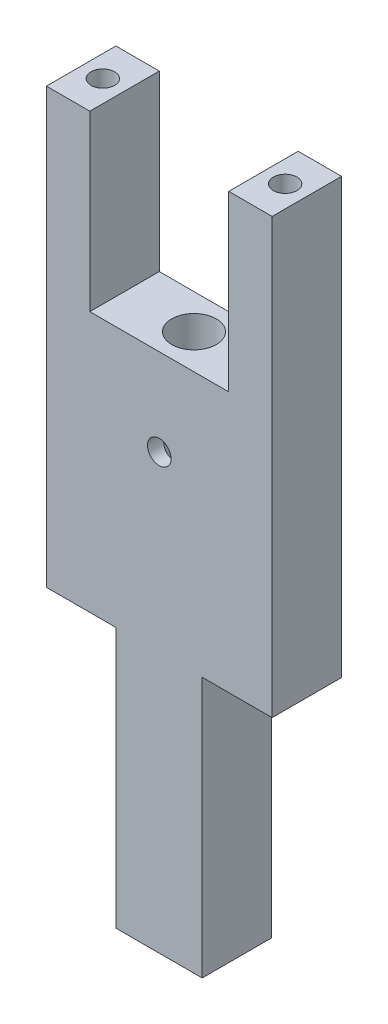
from build123d import *

# Parameters (mm, degrees)
SKETCH1_W                    = 33.02
SKETCH1_H                    = 101.6
BOSS_EXTRUDE2_DEPTH          = 10.16
SKETCH3_W                    = 10.16
SKETCH3_H                    = 38.1
SKETCH3_W_2                  = 10.23189828
CUT_EXTRUDE1_DEPTH           = 10.16
SKETCH4_W                    = 20.32
SKETCH4_H                    = 25.4
CUT_EXTRUDE2_DEPTH           = 10.16
F_0_257_DIAMETER_HOLE1_D     = 6.5278
F_0_257_DIAMETER_HOLE1_DEPTH = 63.5
F_0_257_DIAMETER_HOLE1_TIP   = 1.961148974
F_8_32_TAPPED_HOLE1_D        = 3.4544
F_8_32_TAPPED_HOLE1_DEPTH    = 12.7
F_8_32_TAPPED_HOLE1_TIP      = 1.037806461
F_1_4_20_TAPPED_HOLE1_D      = 5.1054
F_1_4_20_TAPPED_HOLE1_DEPTH  = 12.7
F_1_4_20_TAPPED_HOLE1_TIP    = 1.533816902
F_8_32_TAPPED_HOLE2_REACH    = 84.393
F_8_32_TAPPED_HOLE2_BORE_R   = 1.7272


with BuildPart() as part:
    # Sketch1 → Boss-Extrude2 (new body)
    with BuildSketch(Plane.XY):
        with Locations((-1.367952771, -28.985617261)):
            Rectangle(SKETCH1_W, SKETCH1_H)
    extrude(amount=BOSS_EXTRUDE2_DEPTH)

    # Sketch3 → Cut-Extrude1 (cut)
    with BuildSketch(Plane.XY.offset(10.16)):
        with Locations((-12.797952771, -60.735617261)):
            Rectangle(SKETCH3_W, SKETCH3_H)
        with Locations((10.026098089, -60.735617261)):
            Rectangle(SKETCH3_W_2, SKETCH3_H)
    extrude(amount=-CUT_EXTRUDE1_DEPTH, mode=Mode.SUBTRACT)

    # Sketch4 → Cut-Extrude2 (cut)
    with BuildSketch(Plane.XY.offset(10.16)):
        with Locations((-1.367952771, 9.114382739)):
            Rectangle(SKETCH4_W, SKETCH4_H)
    extrude(amount=-CUT_EXTRUDE2_DEPTH, mode=Mode.SUBTRACT)

    # F _0.257_ Diameter Hole1
    with Locations(Plane(origin=(0, -3.585617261, 0), x_dir=(1, 0, 0), z_dir=(0, 1, 0))):
        with Locations((-1.367952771, -5.08)):
            Hole(F_0_257_DIAMETER_HOLE1_D / 2, depth=F_0_257_DIAMETER_HOLE1_DEPTH)
            with Locations((0, 0, -(F_0_257_DIAMETER_HOLE1_DEPTH + F_0_257_DIAMETER_HOLE1_TIP / 2))):  # 118° drill point
                Cone(0, F_0_257_DIAMETER_HOLE1_D / 2, F_0_257_DIAMETER_HOLE1_TIP, mode=Mode.SUBTRACT)

    # 8-32 Tapped Hole1
    with Locations(Plane(origin=(0, 21.814382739, 0), x_dir=(1, 0, 0), z_dir=(0, 1, 0))):
        with Locations((-14.702952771, -5.08), (11.967047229, -5.08)):
            Hole(F_8_32_TAPPED_HOLE1_D / 2, depth=F_8_32_TAPPED_HOLE1_DEPTH)
            with Locations((0, 0, -(F_8_32_TAPPED_HOLE1_DEPTH + F_8_32_TAPPED_HOLE1_TIP / 2))):  # 118° drill point
                Cone(0, F_8_32_TAPPED_HOLE1_D / 2, F_8_32_TAPPED_HOLE1_TIP, mode=Mode.SUBTRACT)

    # 1_4-20 Tapped Hole1
    with Locations(Plane(origin=(0, -79.785617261, 0), x_dir=(-1, 0, 0), z_dir=(0, -1, 0))):
        with Locations((1.367952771, -5.08)):
            Hole(F_1_4_20_TAPPED_HOLE1_D / 2, depth=F_1_4_20_TAPPED_HOLE1_DEPTH)
            with Locations((0, 0, -(F_1_4_20_TAPPED_HOLE1_DEPTH + F_1_4_20_TAPPED_HOLE1_TIP / 2))):  # 118° drill point
                Cone(0, F_1_4_20_TAPPED_HOLE1_D / 2, F_1_4_20_TAPPED_HOLE1_TIP, mode=Mode.SUBTRACT)

    # 8-32 Tapped Hole2 bore → 8-32 Tapped Hole2 (cut, up to next)
    with BuildSketch(Plane.XY.offset(10.16), mode=Mode.PRIVATE) as f_8_32_tapped_hole2_sk1:
        with Locations((-1.367952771, -16.285617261)):
            Circle(F_8_32_TAPPED_HOLE2_BORE_R)
    f_8_32_tapped_hole2_tool1 = extrude(f_8_32_tapped_hole2_sk1.sketch, amount=-F_8_32_TAPPED_HOLE2_REACH, mode=Mode.PRIVATE) & part.part
    add(f_8_32_tapped_hole2_tool1.solids().sort_by_distance((-1.367953, -16.285617, 10.16))[0], mode=Mode.SUBTRACT)


solid = part.part
